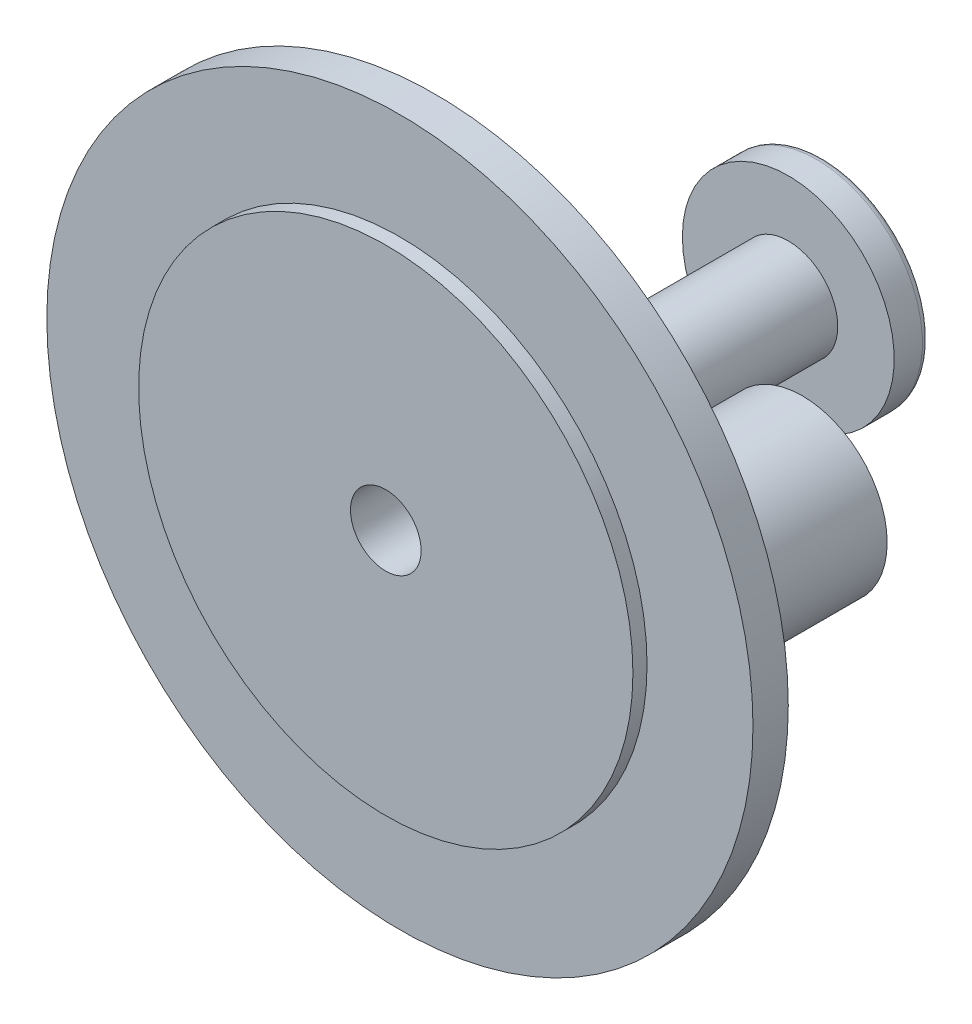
ISO-10303-21;
HEADER;
FILE_DESCRIPTION(('STEP AP214'),'2;1');
FILE_NAME('part.step','',(''),(''),'','','');
FILE_SCHEMA(('AUTOMOTIVE_DESIGN { 1 0 10303 214 1 1 1 1 }'));
ENDSEC;
DATA;
#1=APPLICATION_CONTEXT('core data for automotive mechanical design processes');
#2=APPLICATION_PROTOCOL_DEFINITION('international standard','automotive_design',2000,#1);
#3=PRODUCT_CONTEXT('',#1,'mechanical');
#4=PRODUCT('Part','Part','',(#3));
#5=PRODUCT_RELATED_PRODUCT_CATEGORY('part','',(#4));
#6=PRODUCT_DEFINITION_FORMATION('','',#4);
#7=PRODUCT_DEFINITION_CONTEXT('part definition',#1,'design');
#8=PRODUCT_DEFINITION('design','',#6,#7);
#9=PRODUCT_DEFINITION_SHAPE('','',#8);
#10=(LENGTH_UNIT() NAMED_UNIT(*) SI_UNIT(.MILLI.,.METRE.));
#11=(NAMED_UNIT(*) PLANE_ANGLE_UNIT() SI_UNIT($,.RADIAN.));
#12=(NAMED_UNIT(*) SI_UNIT($,.STERADIAN.) SOLID_ANGLE_UNIT());
#13=UNCERTAINTY_MEASURE_WITH_UNIT(LENGTH_MEASURE(1.E-05),#10,'distance_accuracy_value','');
#14=(GEOMETRIC_REPRESENTATION_CONTEXT(3) GLOBAL_UNCERTAINTY_ASSIGNED_CONTEXT((#13)) GLOBAL_UNIT_ASSIGNED_CONTEXT((#10,
#11,#12)) REPRESENTATION_CONTEXT('',''));
#15=CARTESIAN_POINT('',(0.,0.,0.));
#16=DIRECTION('',(0.,0.,1.));
#17=DIRECTION('',(1.,0.,0.));
#18=AXIS2_PLACEMENT_3D('',#15,#16,#17);
#19=CARTESIAN_POINT('',(0.,0.,0.));
#20=DIRECTION('',(0.,0.,1.));
#21=DIRECTION('',(1.,0.,0.));
#22=AXIS2_PLACEMENT_3D('',#19,#20,#21);
#23=PLANE('',#22);
#24=CARTESIAN_POINT('',(0.,0.,0.));
#25=DIRECTION('',(0.,0.,1.));
#26=DIRECTION('',(1.,0.,0.));
#27=AXIS2_PLACEMENT_3D('',#24,#25,#26);
#28=CIRCLE('',#27,50.);
#29=CARTESIAN_POINT('',(50.,0.,0.));
#30=VERTEX_POINT('',#29);
#31=EDGE_CURVE('E49',#30,#30,#28,.T.);
#32=ORIENTED_EDGE('',*,*,#31,.F.);
#33=EDGE_LOOP('',(#32));
#34=FACE_BOUND('',#33,.T.);
#35=CARTESIAN_POINT('',(0.,0.,0.));
#36=DIRECTION('',(0.,0.,1.));
#37=DIRECTION('',(1.,0.,0.));
#38=AXIS2_PLACEMENT_3D('',#35,#36,#37);
#39=CIRCLE('',#38,7.);
#40=CARTESIAN_POINT('',(7.,0.,0.));
#41=VERTEX_POINT('',#40);
#42=EDGE_CURVE('E41',#41,#41,#39,.F.);
#43=ORIENTED_EDGE('',*,*,#42,.F.);
#44=EDGE_LOOP('',(#43));
#45=FACE_BOUND('',#44,.T.);
#46=CARTESIAN_POINT('',(25.,0.,0.));
#47=DIRECTION('',(0.,0.,1.));
#48=DIRECTION('',(1.,0.,0.));
#49=AXIS2_PLACEMENT_3D('',#46,#47,#48);
#50=CIRCLE('',#49,12.);
#51=CARTESIAN_POINT('',(37.,0.,0.));
#52=VERTEX_POINT('',#51);
#53=EDGE_CURVE('E10',#52,#52,#50,.F.);
#54=ORIENTED_EDGE('',*,*,#53,.F.);
#55=EDGE_LOOP('',(#54));
#56=FACE_BOUND('',#55,.T.);
#57=ADVANCED_FACE('F25',(#34,#45,#56),#23,.F.);
#58=CARTESIAN_POINT('',(0.,0.,5.));
#59=DIRECTION('',(0.,0.,1.));
#60=DIRECTION('',(1.,0.,0.));
#61=AXIS2_PLACEMENT_3D('',#58,#59,#60);
#62=PLANE('',#61);
#63=CARTESIAN_POINT('',(0.,0.,5.));
#64=DIRECTION('',(0.,0.,1.));
#65=DIRECTION('',(1.,0.,0.));
#66=AXIS2_PLACEMENT_3D('',#63,#64,#65);
#67=CIRCLE('',#66,50.);
#68=CARTESIAN_POINT('',(50.,0.,5.));
#69=VERTEX_POINT('',#68);
#70=EDGE_CURVE('E46',#69,#69,#67,.T.);
#71=ORIENTED_EDGE('',*,*,#70,.T.);
#72=EDGE_LOOP('',(#71));
#73=FACE_BOUND('',#72,.T.);
#74=CARTESIAN_POINT('',(0.,0.,5.));
#75=DIRECTION('',(0.,0.,1.));
#76=DIRECTION('',(1.,0.,0.));
#77=AXIS2_PLACEMENT_3D('',#74,#75,#76);
#78=CIRCLE('',#77,35.);
#79=CARTESIAN_POINT('',(35.,0.,5.));
#80=VERTEX_POINT('',#79);
#81=EDGE_CURVE('E55',#80,#80,#78,.T.);
#82=ORIENTED_EDGE('',*,*,#81,.F.);
#83=EDGE_LOOP('',(#82));
#84=FACE_BOUND('',#83,.T.);
#85=ADVANCED_FACE('F97',(#73,#84),#62,.T.);
#86=CARTESIAN_POINT('',(0.,0.,5.));
#87=DIRECTION('',(0.,0.,-1.));
#88=DIRECTION('',(-1.,0.,0.));
#89=AXIS2_PLACEMENT_3D('',#86,#87,#88);
#90=CYLINDRICAL_SURFACE('',#89,50.);
#91=ORIENTED_EDGE('',*,*,#70,.F.);
#92=EDGE_LOOP('',(#91));
#93=FACE_BOUND('',#92,.T.);
#94=ORIENTED_EDGE('',*,*,#31,.T.);
#95=EDGE_LOOP('',(#94));
#96=FACE_BOUND('',#95,.T.);
#97=ADVANCED_FACE('F27',(#93,#96),#90,.T.);
#98=CARTESIAN_POINT('',(0.,0.,7.));
#99=DIRECTION('',(0.,0.,-1.));
#100=DIRECTION('',(-1.,0.,0.));
#101=AXIS2_PLACEMENT_3D('',#98,#99,#100);
#102=CYLINDRICAL_SURFACE('',#101,35.);
#103=CARTESIAN_POINT('',(0.,0.,7.));
#104=DIRECTION('',(0.,0.,1.));
#105=DIRECTION('',(1.,0.,0.));
#106=AXIS2_PLACEMENT_3D('',#103,#104,#105);
#107=CIRCLE('',#106,35.);
#108=CARTESIAN_POINT('',(35.,0.,7.));
#109=VERTEX_POINT('',#108);
#110=EDGE_CURVE('E52',#109,#109,#107,.T.);
#111=ORIENTED_EDGE('',*,*,#110,.F.);
#112=EDGE_LOOP('',(#111));
#113=FACE_BOUND('',#112,.T.);
#114=ORIENTED_EDGE('',*,*,#81,.T.);
#115=EDGE_LOOP('',(#114));
#116=FACE_BOUND('',#115,.T.);
#117=ADVANCED_FACE('F185',(#113,#116),#102,.T.);
#118=CARTESIAN_POINT('',(0.,0.,7.));
#119=DIRECTION('',(0.,0.,1.));
#120=DIRECTION('',(1.,0.,0.));
#121=AXIS2_PLACEMENT_3D('',#118,#119,#120);
#122=PLANE('',#121);
#123=CARTESIAN_POINT('',(0.,0.,7.));
#124=DIRECTION('',(0.,0.,1.));
#125=DIRECTION('',(1.,0.,0.));
#126=AXIS2_PLACEMENT_3D('',#123,#124,#125);
#127=CIRCLE('',#126,5.);
#128=CARTESIAN_POINT('',(5.,0.,7.));
#129=VERTEX_POINT('',#128);
#130=EDGE_CURVE('E61',#129,#129,#127,.T.);
#131=ORIENTED_EDGE('',*,*,#130,.F.);
#132=EDGE_LOOP('',(#131));
#133=FACE_BOUND('',#132,.T.);
#134=ORIENTED_EDGE('',*,*,#110,.T.);
#135=EDGE_LOOP('',(#134));
#136=FACE_BOUND('',#135,.T.);
#137=ADVANCED_FACE('F181',(#133,#136),#122,.T.);
#138=CARTESIAN_POINT('',(0.,0.,-50.));
#139=DIRECTION('',(0.,0.,1.));
#140=DIRECTION('',(1.,0.,0.));
#141=AXIS2_PLACEMENT_3D('',#138,#139,#140);
#142=CYLINDRICAL_SURFACE('',#141,7.);
#143=CARTESIAN_POINT('',(0.,0.,-50.));
#144=DIRECTION('',(0.,0.,-1.));
#145=DIRECTION('',(-1.,0.,0.));
#146=AXIS2_PLACEMENT_3D('',#143,#144,#145);
#147=CIRCLE('',#146,7.);
#148=CARTESIAN_POINT('',(-7.,0.,-50.));
#149=VERTEX_POINT('',#148);
#150=EDGE_CURVE('E58',#149,#149,#147,.T.);
#151=ORIENTED_EDGE('',*,*,#150,.F.);
#152=EDGE_LOOP('',(#151));
#153=FACE_BOUND('',#152,.T.);
#154=ORIENTED_EDGE('',*,*,#42,.T.);
#155=EDGE_LOOP('',(#154));
#156=FACE_BOUND('',#155,.T.);
#157=ADVANCED_FACE('F173',(#153,#156),#142,.T.);
#158=CARTESIAN_POINT('',(0.,0.,-50.));
#159=DIRECTION('',(0.,0.,1.));
#160=DIRECTION('',(1.,0.,0.));
#161=AXIS2_PLACEMENT_3D('',#158,#159,#160);
#162=CYLINDRICAL_SURFACE('',#161,5.);
#163=ORIENTED_EDGE('',*,*,#130,.T.);
#164=EDGE_LOOP('',(#163));
#165=FACE_BOUND('',#164,.T.);
#166=CARTESIAN_POINT('',(0.,0.,-55.));
#167=DIRECTION('',(0.,0.,-1.));
#168=DIRECTION('',(-1.,0.,0.));
#169=AXIS2_PLACEMENT_3D('',#166,#167,#168);
#170=CIRCLE('',#169,5.);
#171=CARTESIAN_POINT('',(-5.,0.,-55.));
#172=VERTEX_POINT('',#171);
#173=EDGE_CURVE('E67',#172,#172,#170,.T.);
#174=ORIENTED_EDGE('',*,*,#173,.T.);
#175=EDGE_LOOP('',(#174));
#176=FACE_BOUND('',#175,.T.);
#177=ADVANCED_FACE('F165',(#165,#176),#162,.F.);
#178=CARTESIAN_POINT('',(0.,0.,-50.));
#179=DIRECTION('',(0.,0.,-1.));
#180=DIRECTION('',(-1.,0.,0.));
#181=AXIS2_PLACEMENT_3D('',#178,#179,#180);
#182=PLANE('',#181);
#183=CARTESIAN_POINT('',(0.,0.,-50.));
#184=DIRECTION('',(0.,0.,-1.));
#185=DIRECTION('',(-1.,0.,0.));
#186=AXIS2_PLACEMENT_3D('',#183,#184,#185);
#187=CIRCLE('',#186,15.);
#188=CARTESIAN_POINT('',(-15.,0.,-50.));
#189=VERTEX_POINT('',#188);
#190=EDGE_CURVE('E64',#189,#189,#187,.T.);
#191=ORIENTED_EDGE('',*,*,#190,.F.);
#192=EDGE_LOOP('',(#191));
#193=FACE_BOUND('',#192,.T.);
#194=ORIENTED_EDGE('',*,*,#150,.T.);
#195=EDGE_LOOP('',(#194));
#196=FACE_BOUND('',#195,.T.);
#197=ADVANCED_FACE('F157',(#193,#196),#182,.F.);
#198=CARTESIAN_POINT('',(0.,0.,-55.));
#199=DIRECTION('',(0.,0.,-1.));
#200=DIRECTION('',(-1.,0.,0.));
#201=AXIS2_PLACEMENT_3D('',#198,#199,#200);
#202=PLANE('',#201);
#203=CARTESIAN_POINT('',(0.,0.,-55.));
#204=DIRECTION('',(0.,0.,-1.));
#205=DIRECTION('',(-1.,0.,0.));
#206=AXIS2_PLACEMENT_3D('',#203,#204,#205);
#207=CIRCLE('',#206,14.);
#208=CARTESIAN_POINT('',(-14.,0.,-55.));
#209=VERTEX_POINT('',#208);
#210=EDGE_CURVE('E37',#209,#209,#207,.T.);
#211=ORIENTED_EDGE('',*,*,#210,.T.);
#212=EDGE_LOOP('',(#211));
#213=FACE_BOUND('',#212,.T.);
#214=ORIENTED_EDGE('',*,*,#173,.F.);
#215=EDGE_LOOP('',(#214));
#216=FACE_BOUND('',#215,.T.);
#217=ADVANCED_FACE('F150',(#213,#216),#202,.T.);
#218=CARTESIAN_POINT('',(0.,0.,-55.));
#219=DIRECTION('',(0.,0.,1.));
#220=DIRECTION('',(1.,0.,0.));
#221=AXIS2_PLACEMENT_3D('',#218,#219,#220);
#222=CYLINDRICAL_SURFACE('',#221,15.);
#223=CARTESIAN_POINT('',(0.,0.,-54.));
#224=DIRECTION('',(0.,0.,-1.));
#225=DIRECTION('',(-1.,0.,0.));
#226=AXIS2_PLACEMENT_3D('',#223,#224,#225);
#227=CIRCLE('',#226,15.);
#228=CARTESIAN_POINT('',(-15.,0.,-54.));
#229=VERTEX_POINT('',#228);
#230=EDGE_CURVE('E33',#229,#229,#227,.F.);
#231=ORIENTED_EDGE('',*,*,#230,.T.);
#232=EDGE_LOOP('',(#231));
#233=FACE_BOUND('',#232,.T.);
#234=ORIENTED_EDGE('',*,*,#190,.T.);
#235=EDGE_LOOP('',(#234));
#236=FACE_BOUND('',#235,.T.);
#237=ADVANCED_FACE('F92',(#233,#236),#222,.T.);
#238=CARTESIAN_POINT('',(0.,0.,-54.));
#239=DIRECTION('',(0.,0.,-1.));
#240=DIRECTION('',(-1.,0.,0.));
#241=AXIS2_PLACEMENT_3D('',#238,#239,#240);
#242=TOROIDAL_SURFACE('',#241,14.,1.);
#243=ORIENTED_EDGE('',*,*,#230,.F.);
#244=EDGE_LOOP('',(#243));
#245=FACE_BOUND('',#244,.T.);
#246=ORIENTED_EDGE('',*,*,#210,.F.);
#247=EDGE_LOOP('',(#246));
#248=FACE_BOUND('',#247,.T.);
#249=ADVANCED_FACE('F84',(#245,#248),#242,.T.);
#250=CARTESIAN_POINT('',(25.,0.,-25.));
#251=DIRECTION('',(0.,0.,1.));
#252=DIRECTION('',(1.,0.,0.));
#253=AXIS2_PLACEMENT_3D('',#250,#251,#252);
#254=CYLINDRICAL_SURFACE('',#253,12.);
#255=ORIENTED_EDGE('',*,*,#53,.T.);
#256=EDGE_LOOP('',(#255));
#257=FACE_BOUND('',#256,.T.);
#258=CARTESIAN_POINT('',(25.,0.,-27.));
#259=DIRECTION('',(0.,0.,-1.));
#260=DIRECTION('',(-1.,0.,0.));
#261=AXIS2_PLACEMENT_3D('',#258,#259,#260);
#262=CIRCLE('',#261,12.);
#263=CARTESIAN_POINT('',(13.,0.,-27.));
#264=VERTEX_POINT('',#263);
#265=EDGE_CURVE('E76',#264,#264,#262,.T.);
#266=ORIENTED_EDGE('',*,*,#265,.F.);
#267=EDGE_LOOP('',(#266));
#268=FACE_BOUND('',#267,.T.);
#269=ADVANCED_FACE('F82',(#257,#268),#254,.T.);
#270=CARTESIAN_POINT('',(25.,0.,-27.));
#271=DIRECTION('',(0.,0.,-1.));
#272=DIRECTION('',(-1.,0.,0.));
#273=AXIS2_PLACEMENT_3D('',#270,#271,#272);
#274=PLANE('',#273);
#275=ORIENTED_EDGE('',*,*,#265,.T.);
#276=EDGE_LOOP('',(#275));
#277=FACE_BOUND('',#276,.T.);
#278=ADVANCED_FACE('F80',(#277),#274,.T.);
#279=CLOSED_SHELL('',(#57,#85,#97,#117,#137,#157,#177,#197,#217,#237,#249,#269,#278));
#280=CARTESIAN_POINT('',(25.,0.,0.));
#281=DIRECTION('',(0.,0.,-1.));
#282=DIRECTION('',(-1.,0.,0.));
#283=AXIS2_PLACEMENT_3D('',#280,#281,#282);
#284=CIRCLE('',#283,10.);
#285=CARTESIAN_POINT('',(15.,0.,0.));
#286=VERTEX_POINT('',#285);
#287=EDGE_CURVE('E70',#286,#286,#284,.T.);
#288=ORIENTED_EDGE('',*,*,#287,.T.);
#289=EDGE_LOOP('',(#288));
#290=FACE_BOUND('',#289,.T.);
#291=ADVANCED_FACE('F100',(#290),#23,.F.);
#292=CARTESIAN_POINT('',(25.,0.,-25.));
#293=DIRECTION('',(0.,0.,1.));
#294=DIRECTION('',(1.,0.,0.));
#295=AXIS2_PLACEMENT_3D('',#292,#293,#294);
#296=CYLINDRICAL_SURFACE('',#295,10.);
#297=CARTESIAN_POINT('',(25.,0.,-25.));
#298=DIRECTION('',(0.,0.,-1.));
#299=DIRECTION('',(-1.,0.,0.));
#300=AXIS2_PLACEMENT_3D('',#297,#298,#299);
#301=CIRCLE('',#300,10.);
#302=CARTESIAN_POINT('',(15.,0.,-25.));
#303=VERTEX_POINT('',#302);
#304=EDGE_CURVE('E73',#303,#303,#301,.T.);
#305=ORIENTED_EDGE('',*,*,#304,.T.);
#306=EDGE_LOOP('',(#305));
#307=FACE_BOUND('',#306,.T.);
#308=ORIENTED_EDGE('',*,*,#287,.F.);
#309=EDGE_LOOP('',(#308));
#310=FACE_BOUND('',#309,.T.);
#311=ADVANCED_FACE('F109',(#307,#310),#296,.F.);
#312=CARTESIAN_POINT('',(25.,0.,-25.));
#313=DIRECTION('',(0.,0.,-1.));
#314=DIRECTION('',(-1.,0.,0.));
#315=AXIS2_PLACEMENT_3D('',#312,#313,#314);
#316=PLANE('',#315);
#317=ORIENTED_EDGE('',*,*,#304,.F.);
#318=EDGE_LOOP('',(#317));
#319=FACE_BOUND('',#318,.T.);
#320=ADVANCED_FACE('F114',(#319),#316,.F.);
#321=CLOSED_SHELL('',(#291,#311,#320));
#322=ORIENTED_CLOSED_SHELL('',*,#321,.T.);
#323=BREP_WITH_VOIDS('B2',#279,(#322));
#324=ADVANCED_BREP_SHAPE_REPRESENTATION('',(#18,#323),#14);
#325=SHAPE_DEFINITION_REPRESENTATION(#9,#324);
ENDSEC;
END-ISO-10303-21;
